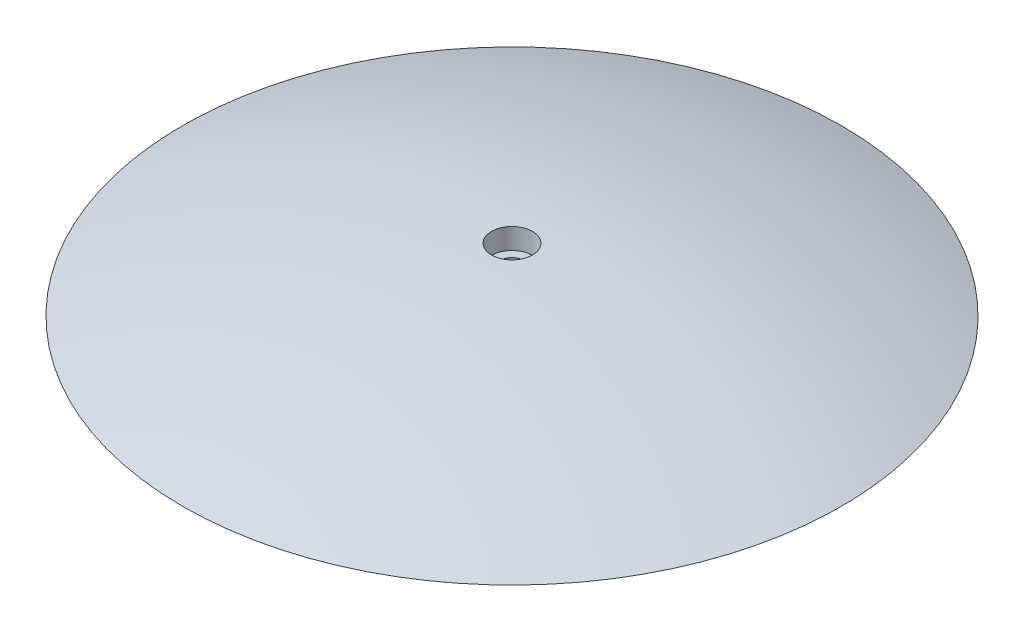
from build123d import *


with BuildPart() as part:
    # Sketch1 → Base-Revolve (revolve)
    with BuildSketch(Plane.XY, mode=Mode.PRIVATE) as base_revolve_sk:
        with BuildLine():
            Line((0.572486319, 0), (15.875, 0))
            ThreePointArc((15.875, 0), (8.561525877, 2.16123871), (0.985897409, 3.037429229))
            Line((0.985897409, 3.037429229), (0.985897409, 2.035522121))
            Line((0.985897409, 2.035522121), (0.572486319, 2.035522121))
            Line((0.572486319, 2.035522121), (0.572486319, 0))
        make_face()
    revolve(base_revolve_sk.sketch.rotate(Axis((0, 33.400371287, 0), (0, -1, 0)), 90), axis=Axis((0, 33.400371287, 0), (0, -1, 0)))


solid = part.part
